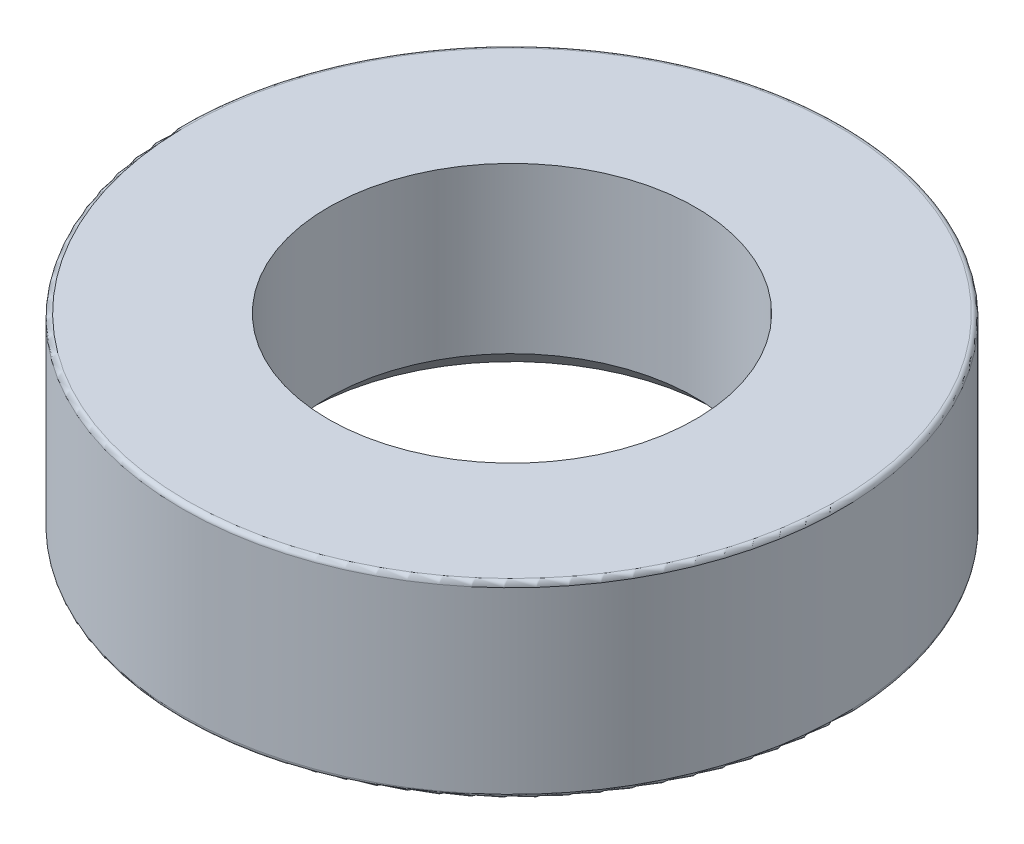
ISO-10303-21;
HEADER;
FILE_DESCRIPTION(('STEP AP214'),'2;1');
FILE_NAME('part.step','',(''),(''),'','','');
FILE_SCHEMA(('AUTOMOTIVE_DESIGN { 1 0 10303 214 1 1 1 1 }'));
ENDSEC;
DATA;
#1=APPLICATION_CONTEXT('core data for automotive mechanical design processes');
#2=APPLICATION_PROTOCOL_DEFINITION('international standard','automotive_design',2000,#1);
#3=PRODUCT_CONTEXT('',#1,'mechanical');
#4=PRODUCT('Part','Part','',(#3));
#5=PRODUCT_RELATED_PRODUCT_CATEGORY('part','',(#4));
#6=PRODUCT_DEFINITION_FORMATION('','',#4);
#7=PRODUCT_DEFINITION_CONTEXT('part definition',#1,'design');
#8=PRODUCT_DEFINITION('design','',#6,#7);
#9=PRODUCT_DEFINITION_SHAPE('','',#8);
#10=(LENGTH_UNIT() NAMED_UNIT(*) SI_UNIT(.MILLI.,.METRE.));
#11=(NAMED_UNIT(*) PLANE_ANGLE_UNIT() SI_UNIT($,.RADIAN.));
#12=(NAMED_UNIT(*) SI_UNIT($,.STERADIAN.) SOLID_ANGLE_UNIT());
#13=UNCERTAINTY_MEASURE_WITH_UNIT(LENGTH_MEASURE(1.E-05),#10,'distance_accuracy_value','');
#14=(GEOMETRIC_REPRESENTATION_CONTEXT(3) GLOBAL_UNCERTAINTY_ASSIGNED_CONTEXT((#13)) GLOBAL_UNIT_ASSIGNED_CONTEXT((#10,
#11,#12)) REPRESENTATION_CONTEXT('',''));
#15=CARTESIAN_POINT('',(0.,0.,0.));
#16=DIRECTION('',(0.,0.,1.));
#17=DIRECTION('',(1.,0.,0.));
#18=AXIS2_PLACEMENT_3D('',#15,#16,#17);
#19=CARTESIAN_POINT('',(0.,2.,0.));
#20=DIRECTION('',(0.,-1.,0.));
#21=DIRECTION('',(0.,0.,-1.));
#22=AXIS2_PLACEMENT_3D('',#19,#20,#21);
#23=CYLINDRICAL_SURFACE('',#22,7.);
#24=CARTESIAN_POINT('',(0.,-1.9,0.));
#25=DIRECTION('',(0.,1.,0.));
#26=DIRECTION('',(0.,0.,1.));
#27=AXIS2_PLACEMENT_3D('',#24,#25,#26);
#28=CIRCLE('',#27,7.);
#29=CARTESIAN_POINT('',(0.,-1.9,7.));
#30=VERTEX_POINT('',#29);
#31=EDGE_CURVE('E41',#30,#30,#28,.T.);
#32=ORIENTED_EDGE('',*,*,#31,.T.);
#33=EDGE_LOOP('',(#32));
#34=FACE_BOUND('',#33,.T.);
#35=CARTESIAN_POINT('',(0.,1.9,0.));
#36=DIRECTION('',(0.,1.,0.));
#37=DIRECTION('',(0.,0.,1.));
#38=AXIS2_PLACEMENT_3D('',#35,#36,#37);
#39=CIRCLE('',#38,7.);
#40=CARTESIAN_POINT('',(0.,1.9,7.));
#41=VERTEX_POINT('',#40);
#42=EDGE_CURVE('E45',#41,#41,#39,.F.);
#43=ORIENTED_EDGE('',*,*,#42,.T.);
#44=EDGE_LOOP('',(#43));
#45=FACE_BOUND('',#44,.T.);
#46=ADVANCED_FACE('F30',(#34,#45),#23,.T.);
#47=CARTESIAN_POINT('',(0.,2.,0.));
#48=DIRECTION('',(0.,1.,0.));
#49=DIRECTION('',(0.,0.,1.));
#50=AXIS2_PLACEMENT_3D('',#47,#48,#49);
#51=PLANE('',#50);
#52=CARTESIAN_POINT('',(0.,2.,0.));
#53=DIRECTION('',(0.,1.,0.));
#54=DIRECTION('',(0.,0.,1.));
#55=AXIS2_PLACEMENT_3D('',#52,#53,#54);
#56=CIRCLE('',#55,6.9);
#57=CARTESIAN_POINT('',(0.,2.,6.9));
#58=VERTEX_POINT('',#57);
#59=EDGE_CURVE('E10',#58,#58,#56,.T.);
#60=ORIENTED_EDGE('',*,*,#59,.T.);
#61=EDGE_LOOP('',(#60));
#62=FACE_BOUND('',#61,.T.);
#63=CARTESIAN_POINT('',(0.,2.,0.));
#64=DIRECTION('',(0.,1.,0.));
#65=DIRECTION('',(0.,0.,1.));
#66=AXIS2_PLACEMENT_3D('',#63,#64,#65);
#67=CIRCLE('',#66,3.9);
#68=CARTESIAN_POINT('',(0.,2.,3.9));
#69=VERTEX_POINT('',#68);
#70=EDGE_CURVE('E56',#69,#69,#67,.T.);
#71=ORIENTED_EDGE('',*,*,#70,.F.);
#72=EDGE_LOOP('',(#71));
#73=FACE_BOUND('',#72,.T.);
#74=ADVANCED_FACE('F62',(#62,#73),#51,.T.);
#75=CARTESIAN_POINT('',(0.,-2.,0.));
#76=DIRECTION('',(0.,1.,0.));
#77=DIRECTION('',(0.,0.,1.));
#78=AXIS2_PLACEMENT_3D('',#75,#76,#77);
#79=PLANE('',#78);
#80=CARTESIAN_POINT('',(0.,-2.,0.));
#81=DIRECTION('',(0.,1.,0.));
#82=DIRECTION('',(0.,0.,1.));
#83=AXIS2_PLACEMENT_3D('',#80,#81,#82);
#84=CIRCLE('',#83,6.9);
#85=CARTESIAN_POINT('',(0.,-2.,6.9));
#86=VERTEX_POINT('',#85);
#87=EDGE_CURVE('E37',#86,#86,#84,.F.);
#88=ORIENTED_EDGE('',*,*,#87,.T.);
#89=EDGE_LOOP('',(#88));
#90=FACE_BOUND('',#89,.T.);
#91=CARTESIAN_POINT('',(0.,-2.,0.));
#92=DIRECTION('',(0.,1.,0.));
#93=DIRECTION('',(0.,0.,1.));
#94=AXIS2_PLACEMENT_3D('',#91,#92,#93);
#95=CIRCLE('',#94,4.4);
#96=CARTESIAN_POINT('',(0.,-2.,4.4));
#97=VERTEX_POINT('',#96);
#98=EDGE_CURVE('E50',#97,#97,#95,.T.);
#99=ORIENTED_EDGE('',*,*,#98,.T.);
#100=EDGE_LOOP('',(#99));
#101=FACE_BOUND('',#100,.T.);
#102=ADVANCED_FACE('F64',(#90,#101),#79,.F.);
#103=CARTESIAN_POINT('',(0.,-2.001,0.));
#104=DIRECTION('',(0.,1.,0.));
#105=DIRECTION('',(0.,0.,1.));
#106=AXIS2_PLACEMENT_3D('',#103,#104,#105);
#107=CYLINDRICAL_SURFACE('',#106,3.9);
#108=CARTESIAN_POINT('',(0.,-1.5,0.));
#109=DIRECTION('',(0.,1.,0.));
#110=DIRECTION('',(0.,0.,1.));
#111=AXIS2_PLACEMENT_3D('',#108,#109,#110);
#112=CIRCLE('',#111,3.9);
#113=CARTESIAN_POINT('',(0.,-1.5,3.9));
#114=VERTEX_POINT('',#113);
#115=EDGE_CURVE('E53',#114,#114,#112,.F.);
#116=ORIENTED_EDGE('',*,*,#115,.T.);
#117=EDGE_LOOP('',(#116));
#118=FACE_BOUND('',#117,.T.);
#119=ORIENTED_EDGE('',*,*,#70,.T.);
#120=EDGE_LOOP('',(#119));
#121=FACE_BOUND('',#120,.T.);
#122=ADVANCED_FACE('F60',(#118,#121),#107,.F.);
#123=CARTESIAN_POINT('',(0.,-1.5,0.));
#124=DIRECTION('',(0.,-1.,0.));
#125=DIRECTION('',(0.,0.,-1.));
#126=AXIS2_PLACEMENT_3D('',#123,#124,#125);
#127=CONICAL_SURFACE('',#126,3.9,0.785398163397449);
#128=ORIENTED_EDGE('',*,*,#98,.F.);
#129=EDGE_LOOP('',(#128));
#130=FACE_BOUND('',#129,.T.);
#131=ORIENTED_EDGE('',*,*,#115,.F.);
#132=EDGE_LOOP('',(#131));
#133=FACE_BOUND('',#132,.T.);
#134=ADVANCED_FACE('F75',(#130,#133),#127,.F.);
#135=CARTESIAN_POINT('',(0.,-1.9,0.));
#136=DIRECTION('',(0.,1.,0.));
#137=DIRECTION('',(0.,0.,1.));
#138=AXIS2_PLACEMENT_3D('',#135,#136,#137);
#139=TOROIDAL_SURFACE('',#138,6.9,0.1);
#140=ORIENTED_EDGE('',*,*,#87,.F.);
#141=EDGE_LOOP('',(#140));
#142=FACE_BOUND('',#141,.T.);
#143=ORIENTED_EDGE('',*,*,#31,.F.);
#144=EDGE_LOOP('',(#143));
#145=FACE_BOUND('',#144,.T.);
#146=ADVANCED_FACE('F77',(#142,#145),#139,.T.);
#147=CARTESIAN_POINT('',(0.,1.9,0.));
#148=DIRECTION('',(0.,1.,0.));
#149=DIRECTION('',(0.,0.,1.));
#150=AXIS2_PLACEMENT_3D('',#147,#148,#149);
#151=TOROIDAL_SURFACE('',#150,6.9,0.1);
#152=ORIENTED_EDGE('',*,*,#42,.F.);
#153=EDGE_LOOP('',(#152));
#154=FACE_BOUND('',#153,.T.);
#155=ORIENTED_EDGE('',*,*,#59,.F.);
#156=EDGE_LOOP('',(#155));
#157=FACE_BOUND('',#156,.T.);
#158=ADVANCED_FACE('F32',(#154,#157),#151,.T.);
#159=CLOSED_SHELL('',(#46,#74,#102,#122,#134,#146,#158));
#160=MANIFOLD_SOLID_BREP('B2',#159);
#161=ADVANCED_BREP_SHAPE_REPRESENTATION('',(#18,#160),#14);
#162=SHAPE_DEFINITION_REPRESENTATION(#9,#161);
ENDSEC;
END-ISO-10303-21;
